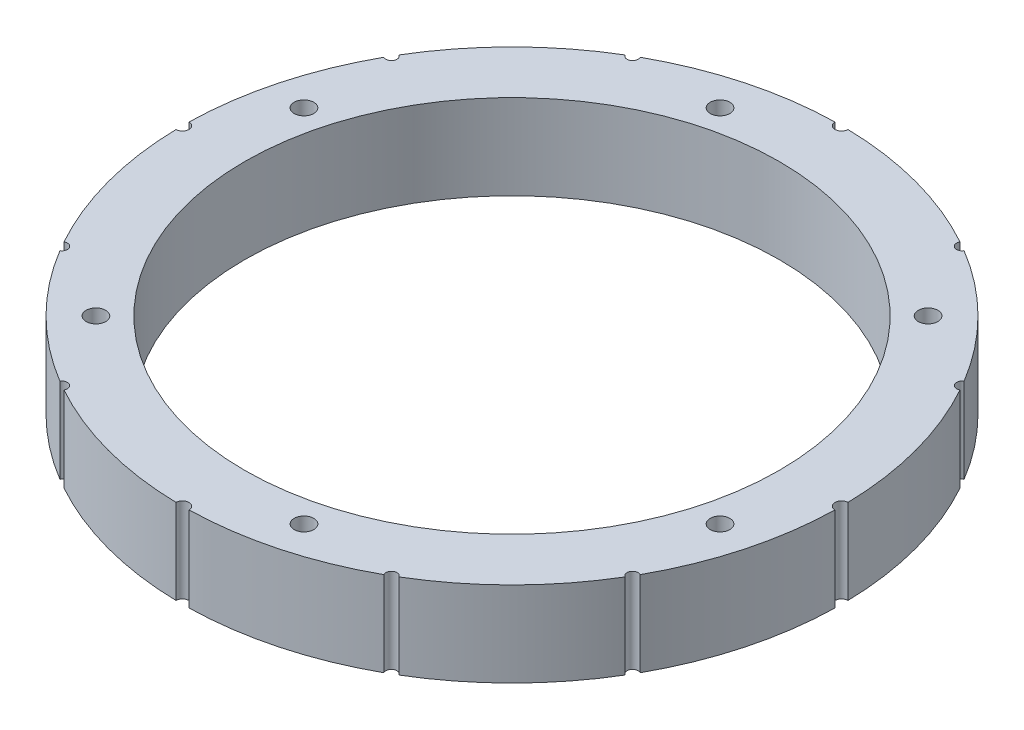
from build123d import *

# Parameters (mm, degrees)
SKETCH_1_R               = 50.4
SKETCH_1_R_2             = 40.9
EXTRUDE_1_DEPTH          = 13
SKETCH_2_R               = 1
SKETCH_2_R_2             = 0.85
CUT_EXTRUDE_1_DEPTH      = 13
SKETCH_3_R               = 1.5
CUT_EXTRUDE_2_DEPTH      = 5
PATTERN_CIRCULAR_1_COUNT = 6


with BuildPart() as part:
    # Sketch 1 → Extrude 1 (new body)
    with BuildSketch(Plane(origin=(0, 0, 0), x_dir=(1, 0, 0), z_dir=(0, 1, 0))):
        with Locations(Location((0, 0, 0), (0, 0, 270))):
            Circle(SKETCH_1_R)
        with Locations(Location((0, 0, 0), (0, 0, 270))):
            Circle(SKETCH_1_R_2, mode=Mode.SUBTRACT)
    extrude(amount=-EXTRUDE_1_DEPTH)

    # Sketch 2 → Cut-Extrude 1 (cut)
    with BuildSketch(Plane.XZ.offset(13)):
        with Locations((0, 50.4)):
            Circle(SKETCH_2_R)
        with Locations((50.4, 0)):
            Circle(SKETCH_2_R)
        with Locations((0, -50.4)):
            Circle(SKETCH_2_R)
        with Locations((-50.4, 0)):
            Circle(SKETCH_2_R)
        with Locations((-25.2, 43.647680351)):
            Circle(SKETCH_2_R_2)
        with Locations((25.2, 43.647680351)):
            Circle(SKETCH_2_R_2)
        with Locations((43.647680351, 25.2)):
            Circle(SKETCH_2_R_2)
        with Locations((43.647680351, -25.2)):
            Circle(SKETCH_2_R_2)
        with Locations((25.2, -43.647680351)):
            Circle(SKETCH_2_R_2)
        with Locations((-25.2, -43.647680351)):
            Circle(SKETCH_2_R_2)
        with Locations((-43.647680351, -25.2)):
            Circle(SKETCH_2_R_2)
        with Locations((-43.647680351, 25.2)):
            Circle(SKETCH_2_R_2)
    extrude(amount=-CUT_EXTRUDE_1_DEPTH, mode=Mode.SUBTRACT)

    # Sketch 3 → Cut-Extrude 2 (cut)
    with BuildSketch(Plane(origin=(0, 0, 0), x_dir=(1, 0, 0), z_dir=(0, 1, 0))):
        with Locations(Location((-11.64685703, 43.466662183, 0), (0, 0, 270))):
            Circle(SKETCH_3_R)
    cut_extrude_2 = extrude(amount=-CUT_EXTRUDE_2_DEPTH, mode=Mode.SUBTRACT)

    # Pattern Circular 1: Cut-Extrude 2 ×6 about axis
    pattern_circular_1_axis = Axis((0, 0, 0), (0, 1, 0))
    for i in range(1, PATTERN_CIRCULAR_1_COUNT):
        add(cut_extrude_2.rotate(pattern_circular_1_axis, i * 360 / PATTERN_CIRCULAR_1_COUNT), mode=Mode.SUBTRACT)


solid = part.part
